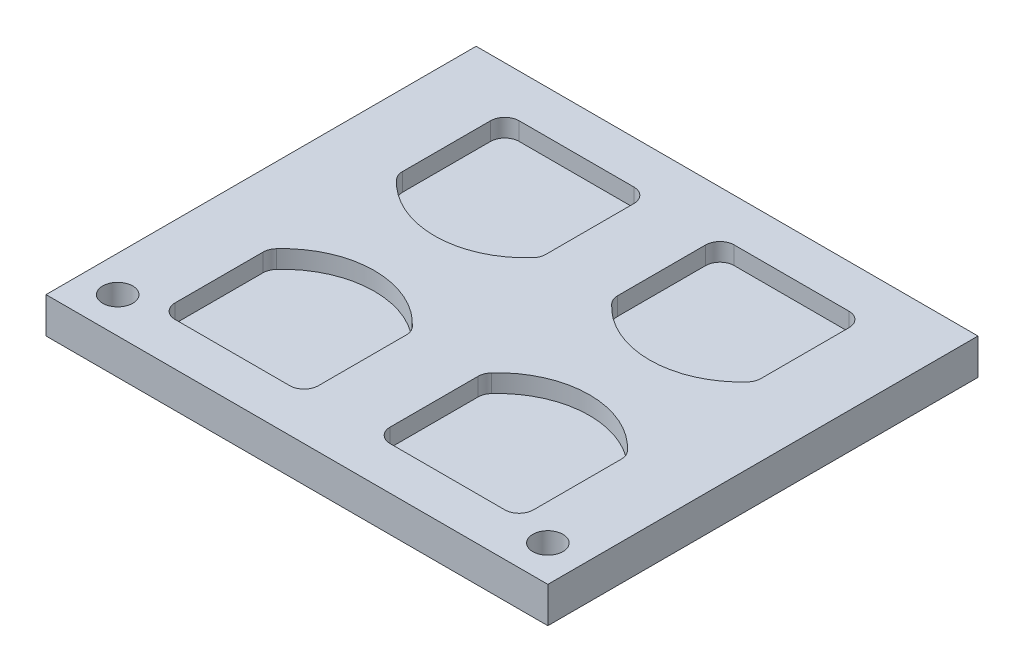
from build123d import *

# Parameters (mm, degrees)
SKETCH1_W              = 350
SKETCH1_H              = 300
BOSS_EXTRUDE1_DEPTH    = 25
CUT_EXTRUDE1_DEPTH     = 12.5
M24X3_0_TAPPED_HOLE1_D = 21
FILLET1_R              = 10


with BuildPart() as part:
    # Sketch1 → Boss-Extrude1 (new body)
    with BuildSketch(Plane(origin=(0, 0, 0), x_dir=(1, 0, 0), z_dir=(0, 1, 0))):
        Rectangle(SKETCH1_W, SKETCH1_H)
    extrude(amount=BOSS_EXTRUDE1_DEPTH)

    # Sketch2 → Cut-Extrude1 (cut)
    with BuildSketch(Plane(origin=(0, 25, 0), x_dir=(1, 0, 0), z_dir=(0, 1, 0))):
        with BuildLine():
            Line((-125, -120), (-25, -120))
            Line((-25, -120), (-25, -45))
            ThreePointArc((-25, -45), (-75, -20.968757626), (-125, -45))
            Line((-125, -45), (-125, -120))
        make_face()
        with BuildLine():
            Line((25, -120), (25, -45))
            ThreePointArc((25, -45), (75, -20.968757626), (125, -45))
            Line((125, -45), (125, -120))
            Line((125, -120), (25, -120))
        make_face()
        with BuildLine():
            Line((125, 120), (25, 120))
            Line((25, 120), (25, 45))
            ThreePointArc((25, 45), (75, 20.968757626), (125, 45))
            Line((125, 45), (125, 120))
        make_face()
        with BuildLine():
            Line((-25, 120), (-25, 45))
            ThreePointArc((-25, 45), (-75, 20.968757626), (-125, 45))
            Line((-125, 45), (-125, 120))
            Line((-125, 120), (-25, 120))
        make_face()
    extrude(amount=-CUT_EXTRUDE1_DEPTH, mode=Mode.SUBTRACT)

    # M24x3.0 Tapped Hole1 (through all)
    with Locations(Plane(origin=(0, 25, 0), x_dir=(1, 0, 0), z_dir=(0, 1, 0))):
        with Locations((-150, -125), (150, -125)):
            Hole(M24X3_0_TAPPED_HOLE1_D / 2)

    # Fillet1
    fillet1_edges = [part.edges().sort_by_distance(p)[0] for p in [
        (-25, 18.75, -45),
        (-125, 18.75, -45),
        (-125, 18.75, -120),
        (-25, 18.75, -120),
        (125, 18.75, -45),
        (25, 18.75, -45),
        (25, 18.75, -120),
        (125, 18.75, -120),
        (25, 18.75, 45),
        (125, 18.75, 45),
        (125, 18.75, 120),
        (25, 18.75, 120),
        (-125, 18.75, 120),
        (-125, 18.75, 45),
        (-25, 18.75, 45),
        (-25, 18.75, 120),
    ]]
    fillet(fillet1_edges, radius=FILLET1_R)


solid = part.part
